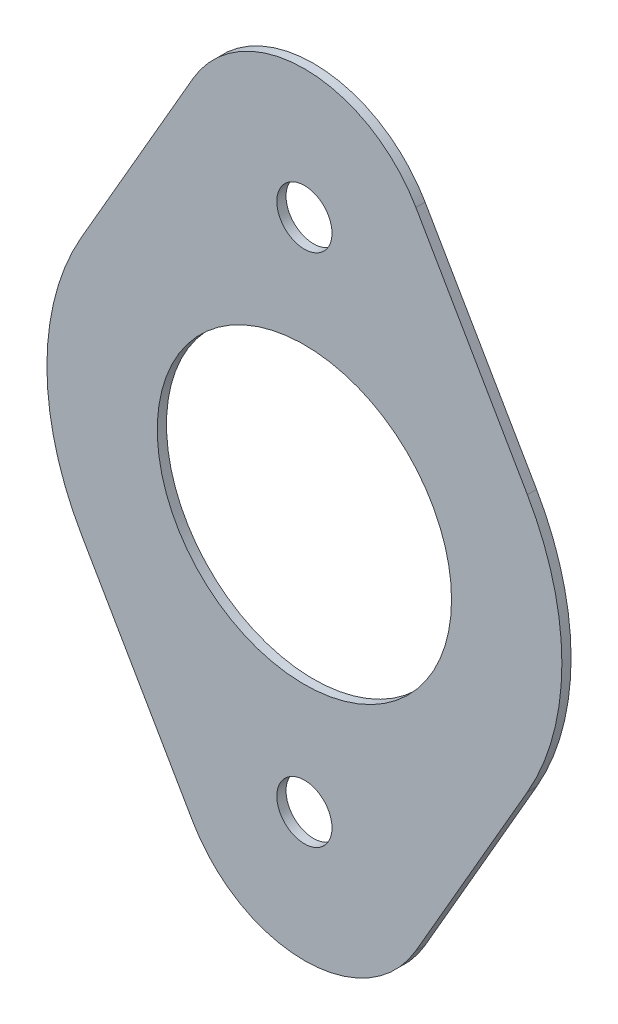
from build123d import *

# Parameters (mm, degrees)
MAIN_DEPTH  = 1.5875
SKETCH2_R   = 4.7625
SKETCH2_R_2 = 25.4
HOLES_DEPTH = 81.149100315


with BuildPart() as part:
    # Sketch1 → Main (new body)
    with BuildSketch(Plane.XY):
        with BuildLine():
            Line((19.247414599, 55.5625), (38.494829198, 22.225))
            ThreePointArc((38.494829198, 22.225), (44.45, 0), (38.494829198, -22.225))
            Line((38.494829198, -22.225), (19.247414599, -55.5625))
            ThreePointArc((19.247414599, -55.5625), (0, -66.675), (-19.247414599, -55.5625))
            Line((-19.247414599, -55.5625), (-38.494829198, -22.225))
            ThreePointArc((-38.494829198, -22.225), (-44.45, 0), (-38.494829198, 22.225))
            Line((-38.494829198, 22.225), (-19.247414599, 55.5625))
            ThreePointArc((-19.247414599, 55.5625), (0, 66.675), (19.247414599, 55.5625))
        make_face()
    extrude(amount=MAIN_DEPTH)

    # Sketch2 → Holes (cut, through all)
    with BuildSketch(Plane.XY.offset(1.5875)):
        with Locations((0, 44.45)):
            Circle(SKETCH2_R)
        with Locations((0, -44.45)):
            Circle(SKETCH2_R)
        Circle(SKETCH2_R_2)
    extrude(amount=-HOLES_DEPTH, mode=Mode.SUBTRACT)


solid = part.part
